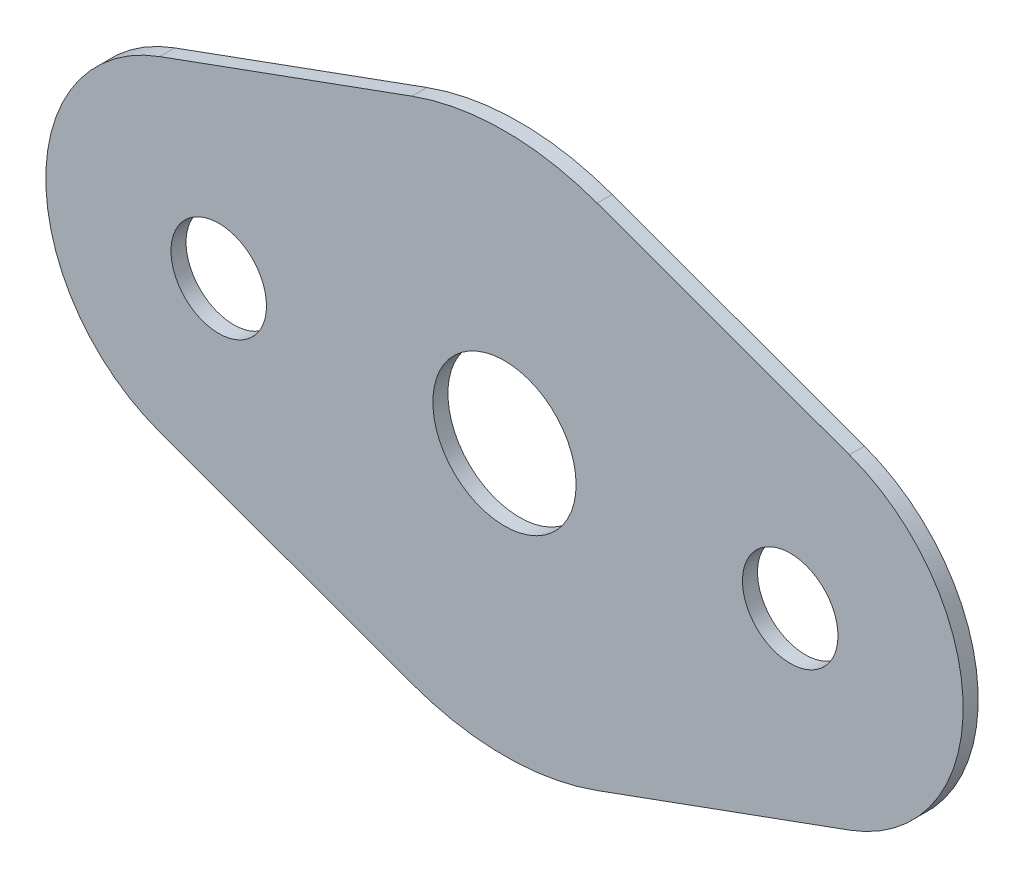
from build123d import *

# Parameters (mm, degrees)
SKETCH1_R          = 3.175
SKETCH1_R_2        = 4.7625
BASE_EXTRUDE_DEPTH = 1


with BuildPart() as part:
    # Sketch1 → Base-Extrude (new body)
    with BuildSketch(Plane.XY):
        with BuildLine():
            Line((6.157894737, -16.913909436), (22.934210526, -10.806108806))
            ThreePointArc((22.934210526, -10.806108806), (30.5, 0), (22.934210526, 10.806108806))
            Line((22.934210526, 10.806108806), (6.157894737, 16.913909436))
            ThreePointArc((6.157894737, 16.913909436), (0, 18), (-6.157894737, 16.913909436))
            Line((-6.157894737, 16.913909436), (-22.934210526, 10.806108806))
            ThreePointArc((-22.934210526, 10.806108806), (-30.5, 0), (-22.934210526, -10.806108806))
            Line((-22.934210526, -10.806108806), (-6.157894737, -16.913909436))
            ThreePointArc((-6.157894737, -16.913909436), (0, -18), (6.157894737, -16.913909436))
        make_face()
        with Locations((19, 0)):
            Circle(SKETCH1_R, mode=Mode.SUBTRACT)
        Circle(SKETCH1_R_2, mode=Mode.SUBTRACT)
        with Locations((-19, 0)):
            Circle(SKETCH1_R, mode=Mode.SUBTRACT)
    extrude(amount=BASE_EXTRUDE_DEPTH)


solid = part.part
